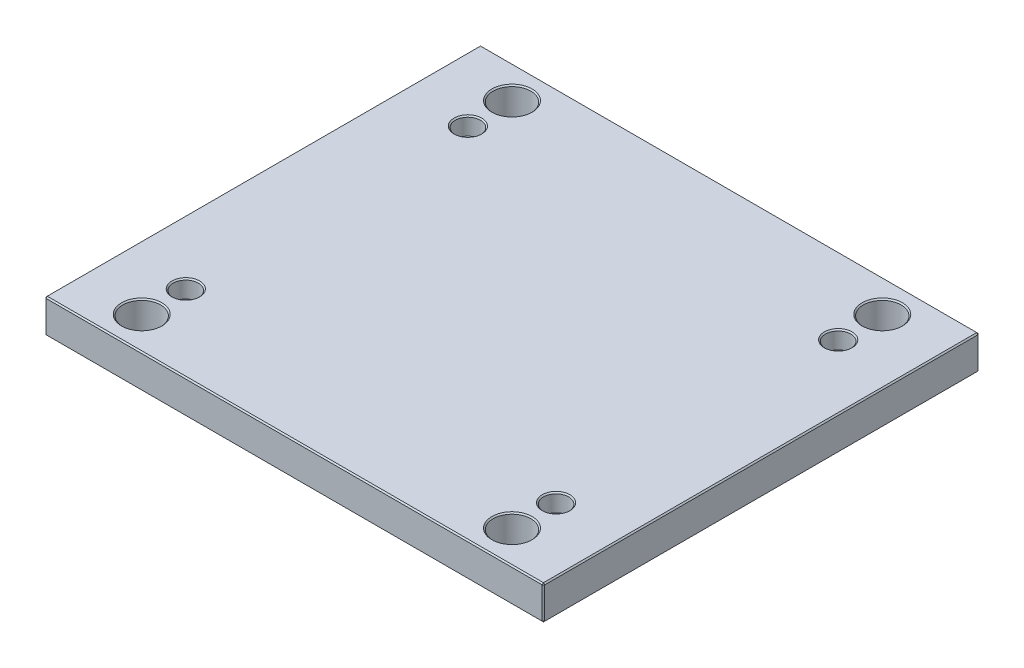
ISO-10303-21;
HEADER;
FILE_DESCRIPTION(('STEP AP214'),'2;1');
FILE_NAME('part.step','',(''),(''),'','','');
FILE_SCHEMA(('AUTOMOTIVE_DESIGN { 1 0 10303 214 1 1 1 1 }'));
ENDSEC;
DATA;
#1=APPLICATION_CONTEXT('core data for automotive mechanical design processes');
#2=APPLICATION_PROTOCOL_DEFINITION('international standard','automotive_design',2000,#1);
#3=PRODUCT_CONTEXT('',#1,'mechanical');
#4=PRODUCT('Part','Part','',(#3));
#5=PRODUCT_RELATED_PRODUCT_CATEGORY('part','',(#4));
#6=PRODUCT_DEFINITION_FORMATION('','',#4);
#7=PRODUCT_DEFINITION_CONTEXT('part definition',#1,'design');
#8=PRODUCT_DEFINITION('design','',#6,#7);
#9=PRODUCT_DEFINITION_SHAPE('','',#8);
#10=(LENGTH_UNIT() NAMED_UNIT(*) SI_UNIT(.MILLI.,.METRE.));
#11=(NAMED_UNIT(*) PLANE_ANGLE_UNIT() SI_UNIT($,.RADIAN.));
#12=(NAMED_UNIT(*) SI_UNIT($,.STERADIAN.) SOLID_ANGLE_UNIT());
#13=UNCERTAINTY_MEASURE_WITH_UNIT(LENGTH_MEASURE(1.E-05),#10,'distance_accuracy_value','');
#14=(GEOMETRIC_REPRESENTATION_CONTEXT(3) GLOBAL_UNCERTAINTY_ASSIGNED_CONTEXT((#13)) GLOBAL_UNIT_ASSIGNED_CONTEXT((#10,
#11,#12)) REPRESENTATION_CONTEXT('',''));
#15=CARTESIAN_POINT('',(0.,0.,0.));
#16=DIRECTION('',(0.,0.,1.));
#17=DIRECTION('',(1.,0.,0.));
#18=AXIS2_PLACEMENT_3D('',#15,#16,#17);
#19=CARTESIAN_POINT('',(-198.,27.,173.));
#20=DIRECTION('',(1.,0.,0.));
#21=DIRECTION('',(0.,0.,-1.));
#22=AXIS2_PLACEMENT_3D('',#19,#20,#21);
#23=PLANE('',#22);
#24=DIRECTION('',(0.,-1.,0.));
#25=VECTOR('',#24,1.);
#26=CARTESIAN_POINT('',(-198.,27.,-172.));
#27=LINE('',#26,#25);
#28=CARTESIAN_POINT('',(-198.,26.,-172.));
#29=VERTEX_POINT('',#28);
#30=CARTESIAN_POINT('',(-198.,1.,-172.));
#31=VERTEX_POINT('',#30);
#32=EDGE_CURVE('E115',#29,#31,#27,.T.);
#33=ORIENTED_EDGE('',*,*,#32,.T.);
#34=DIRECTION('',(0.,0.,1.));
#35=VECTOR('',#34,1.);
#36=CARTESIAN_POINT('',(-198.,1.,173.));
#37=LINE('',#36,#35);
#38=CARTESIAN_POINT('',(-198.,1.,172.));
#39=VERTEX_POINT('',#38);
#40=EDGE_CURVE('E111',#31,#39,#37,.T.);
#41=ORIENTED_EDGE('',*,*,#40,.T.);
#42=DIRECTION('',(0.,1.,0.));
#43=VECTOR('',#42,1.);
#44=CARTESIAN_POINT('',(-198.,27.,172.));
#45=LINE('',#44,#43);
#46=CARTESIAN_POINT('',(-198.,26.,172.));
#47=VERTEX_POINT('',#46);
#48=EDGE_CURVE('E104',#39,#47,#45,.T.);
#49=ORIENTED_EDGE('',*,*,#48,.T.);
#50=DIRECTION('',(0.,0.,-1.));
#51=VECTOR('',#50,1.);
#52=CARTESIAN_POINT('',(-198.,26.,-173.));
#53=LINE('',#52,#51);
#54=EDGE_CURVE('E108',#47,#29,#53,.T.);
#55=ORIENTED_EDGE('',*,*,#54,.T.);
#56=EDGE_LOOP('',(#33,#41,#49,#55));
#57=FACE_BOUND('',#56,.T.);
#58=ADVANCED_FACE('F16',(#57),#23,.F.);
#59=CARTESIAN_POINT('',(198.,27.,173.));
#60=DIRECTION('',(0.,0.,-1.));
#61=DIRECTION('',(-1.,0.,0.));
#62=AXIS2_PLACEMENT_3D('',#59,#60,#61);
#63=PLANE('',#62);
#64=DIRECTION('',(-1.,0.,0.));
#65=VECTOR('',#64,1.);
#66=CARTESIAN_POINT('',(-198.,26.,173.));
#67=LINE('',#66,#65);
#68=CARTESIAN_POINT('',(197.,26.,173.));
#69=VERTEX_POINT('',#68);
#70=CARTESIAN_POINT('',(-197.,26.,173.));
#71=VERTEX_POINT('',#70);
#72=EDGE_CURVE('E170',#69,#71,#67,.T.);
#73=ORIENTED_EDGE('',*,*,#72,.T.);
#74=DIRECTION('',(0.,-1.,0.));
#75=VECTOR('',#74,1.);
#76=CARTESIAN_POINT('',(-197.,27.,173.));
#77=LINE('',#76,#75);
#78=CARTESIAN_POINT('',(-197.,1.,173.));
#79=VERTEX_POINT('',#78);
#80=EDGE_CURVE('E123',#71,#79,#77,.T.);
#81=ORIENTED_EDGE('',*,*,#80,.T.);
#82=DIRECTION('',(1.,0.,0.));
#83=VECTOR('',#82,1.);
#84=CARTESIAN_POINT('',(198.,1.,173.));
#85=LINE('',#84,#83);
#86=CARTESIAN_POINT('',(197.,1.,173.));
#87=VERTEX_POINT('',#86);
#88=EDGE_CURVE('E174',#79,#87,#85,.T.);
#89=ORIENTED_EDGE('',*,*,#88,.T.);
#90=DIRECTION('',(0.,1.,0.));
#91=VECTOR('',#90,1.);
#92=CARTESIAN_POINT('',(197.,27.,173.));
#93=LINE('',#92,#91);
#94=EDGE_CURVE('E172',#87,#69,#93,.T.);
#95=ORIENTED_EDGE('',*,*,#94,.T.);
#96=EDGE_LOOP('',(#73,#81,#89,#95));
#97=FACE_BOUND('',#96,.T.);
#98=ADVANCED_FACE('F413',(#97),#63,.F.);
#99=CARTESIAN_POINT('',(198.,27.,173.));
#100=DIRECTION('',(-1.,0.,0.));
#101=DIRECTION('',(0.,0.,1.));
#102=AXIS2_PLACEMENT_3D('',#99,#100,#101);
#103=PLANE('',#102);
#104=DIRECTION('',(0.,0.,-1.));
#105=VECTOR('',#104,1.);
#106=CARTESIAN_POINT('',(198.,1.,173.));
#107=LINE('',#106,#105);
#108=CARTESIAN_POINT('',(198.,1.,172.));
#109=VERTEX_POINT('',#108);
#110=CARTESIAN_POINT('',(198.,1.,-172.));
#111=VERTEX_POINT('',#110);
#112=EDGE_CURVE('E165',#109,#111,#107,.T.);
#113=ORIENTED_EDGE('',*,*,#112,.T.);
#114=DIRECTION('',(0.,1.,0.));
#115=VECTOR('',#114,1.);
#116=CARTESIAN_POINT('',(198.,27.,-172.));
#117=LINE('',#116,#115);
#118=CARTESIAN_POINT('',(198.,26.,-172.));
#119=VERTEX_POINT('',#118);
#120=EDGE_CURVE('E167',#111,#119,#117,.T.);
#121=ORIENTED_EDGE('',*,*,#120,.T.);
#122=DIRECTION('',(0.,0.,1.));
#123=VECTOR('',#122,1.);
#124=CARTESIAN_POINT('',(198.,26.,173.));
#125=LINE('',#124,#123);
#126=CARTESIAN_POINT('',(198.,26.,172.));
#127=VERTEX_POINT('',#126);
#128=EDGE_CURVE('E161',#119,#127,#125,.T.);
#129=ORIENTED_EDGE('',*,*,#128,.T.);
#130=DIRECTION('',(0.,-1.,0.));
#131=VECTOR('',#130,1.);
#132=CARTESIAN_POINT('',(198.,27.,172.));
#133=LINE('',#132,#131);
#134=EDGE_CURVE('E163',#127,#109,#133,.T.);
#135=ORIENTED_EDGE('',*,*,#134,.T.);
#136=EDGE_LOOP('',(#113,#121,#129,#135));
#137=FACE_BOUND('',#136,.T.);
#138=ADVANCED_FACE('F406',(#137),#103,.F.);
#139=CARTESIAN_POINT('',(198.,27.,-173.));
#140=DIRECTION('',(0.,0.,1.));
#141=DIRECTION('',(1.,0.,0.));
#142=AXIS2_PLACEMENT_3D('',#139,#140,#141);
#143=PLANE('',#142);
#144=DIRECTION('',(0.,-1.,0.));
#145=VECTOR('',#144,1.);
#146=CARTESIAN_POINT('',(197.,27.,-173.));
#147=LINE('',#146,#145);
#148=CARTESIAN_POINT('',(197.,26.,-173.));
#149=VERTEX_POINT('',#148);
#150=CARTESIAN_POINT('',(197.,1.,-173.));
#151=VERTEX_POINT('',#150);
#152=EDGE_CURVE('E154',#149,#151,#147,.T.);
#153=ORIENTED_EDGE('',*,*,#152,.T.);
#154=DIRECTION('',(-1.,0.,0.));
#155=VECTOR('',#154,1.);
#156=CARTESIAN_POINT('',(198.,1.,-173.));
#157=LINE('',#156,#155);
#158=CARTESIAN_POINT('',(-197.,1.,-173.));
#159=VERTEX_POINT('',#158);
#160=EDGE_CURVE('E159',#151,#159,#157,.T.);
#161=ORIENTED_EDGE('',*,*,#160,.T.);
#162=DIRECTION('',(0.,1.,0.));
#163=VECTOR('',#162,1.);
#164=CARTESIAN_POINT('',(-197.,27.,-173.));
#165=LINE('',#164,#163);
#166=CARTESIAN_POINT('',(-197.,26.,-173.));
#167=VERTEX_POINT('',#166);
#168=EDGE_CURVE('E156',#159,#167,#165,.T.);
#169=ORIENTED_EDGE('',*,*,#168,.T.);
#170=DIRECTION('',(1.,0.,0.));
#171=VECTOR('',#170,1.);
#172=CARTESIAN_POINT('',(198.,26.,-173.));
#173=LINE('',#172,#171);
#174=EDGE_CURVE('E152',#167,#149,#173,.T.);
#175=ORIENTED_EDGE('',*,*,#174,.T.);
#176=EDGE_LOOP('',(#153,#161,#169,#175));
#177=FACE_BOUND('',#176,.T.);
#178=ADVANCED_FACE('F431',(#177),#143,.F.);
#179=CARTESIAN_POINT('',(0.,27.,0.));
#180=DIRECTION('',(0.,1.,0.));
#181=DIRECTION('',(0.,0.,1.));
#182=AXIS2_PLACEMENT_3D('',#179,#180,#181);
#183=PLANE('',#182);
#184=CARTESIAN_POINT('',(-147.,27.,147.));
#185=DIRECTION('',(0.,1.,0.));
#186=DIRECTION('',(0.,0.,1.));
#187=AXIS2_PLACEMENT_3D('',#184,#185,#186);
#188=CIRCLE('',#187,16.);
#189=CARTESIAN_POINT('',(-147.,27.,163.));
#190=VERTEX_POINT('',#189);
#191=EDGE_CURVE('E317',#190,#190,#188,.F.);
#192=ORIENTED_EDGE('',*,*,#191,.T.);
#193=EDGE_LOOP('',(#192));
#194=FACE_BOUND('',#193,.T.);
#195=CARTESIAN_POINT('',(147.,27.,147.));
#196=DIRECTION('',(0.,1.,0.));
#197=DIRECTION('',(0.,0.,1.));
#198=AXIS2_PLACEMENT_3D('',#195,#196,#197);
#199=CIRCLE('',#198,16.);
#200=CARTESIAN_POINT('',(147.,27.,163.));
#201=VERTEX_POINT('',#200);
#202=EDGE_CURVE('E314',#201,#201,#199,.F.);
#203=ORIENTED_EDGE('',*,*,#202,.T.);
#204=EDGE_LOOP('',(#203));
#205=FACE_BOUND('',#204,.T.);
#206=CARTESIAN_POINT('',(147.,27.,-147.));
#207=DIRECTION('',(0.,1.,0.));
#208=DIRECTION('',(0.,0.,1.));
#209=AXIS2_PLACEMENT_3D('',#206,#207,#208);
#210=CIRCLE('',#209,16.);
#211=CARTESIAN_POINT('',(147.,27.,-131.));
#212=VERTEX_POINT('',#211);
#213=EDGE_CURVE('E311',#212,#212,#210,.F.);
#214=ORIENTED_EDGE('',*,*,#213,.T.);
#215=EDGE_LOOP('',(#214));
#216=FACE_BOUND('',#215,.T.);
#217=CARTESIAN_POINT('',(-147.,27.,-147.));
#218=DIRECTION('',(0.,1.,0.));
#219=DIRECTION('',(0.,0.,1.));
#220=AXIS2_PLACEMENT_3D('',#217,#218,#219);
#221=CIRCLE('',#220,16.);
#222=CARTESIAN_POINT('',(-147.,27.,-131.));
#223=VERTEX_POINT('',#222);
#224=EDGE_CURVE('E308',#223,#223,#221,.F.);
#225=ORIENTED_EDGE('',*,*,#224,.T.);
#226=EDGE_LOOP('',(#225));
#227=FACE_BOUND('',#226,.T.);
#228=CARTESIAN_POINT('',(-147.,27.,112.));
#229=DIRECTION('',(0.,1.,0.));
#230=DIRECTION('',(0.,0.,1.));
#231=AXIS2_PLACEMENT_3D('',#228,#229,#230);
#232=CIRCLE('',#231,11.0000000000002);
#233=CARTESIAN_POINT('',(-147.,27.,123.));
#234=VERTEX_POINT('',#233);
#235=EDGE_CURVE('E290',#234,#234,#232,.F.);
#236=ORIENTED_EDGE('',*,*,#235,.T.);
#237=EDGE_LOOP('',(#236));
#238=FACE_BOUND('',#237,.T.);
#239=CARTESIAN_POINT('',(147.,27.,112.));
#240=DIRECTION('',(0.,1.,0.));
#241=DIRECTION('',(0.,0.,1.));
#242=AXIS2_PLACEMENT_3D('',#239,#240,#241);
#243=CIRCLE('',#242,11.0000000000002);
#244=CARTESIAN_POINT('',(147.,27.,123.));
#245=VERTEX_POINT('',#244);
#246=EDGE_CURVE('E287',#245,#245,#243,.F.);
#247=ORIENTED_EDGE('',*,*,#246,.T.);
#248=EDGE_LOOP('',(#247));
#249=FACE_BOUND('',#248,.T.);
#250=CARTESIAN_POINT('',(147.,27.,-112.));
#251=DIRECTION('',(0.,1.,0.));
#252=DIRECTION('',(0.,0.,1.));
#253=AXIS2_PLACEMENT_3D('',#250,#251,#252);
#254=CIRCLE('',#253,11.0000000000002);
#255=CARTESIAN_POINT('',(147.,27.,-101.));
#256=VERTEX_POINT('',#255);
#257=EDGE_CURVE('E284',#256,#256,#254,.F.);
#258=ORIENTED_EDGE('',*,*,#257,.T.);
#259=EDGE_LOOP('',(#258));
#260=FACE_BOUND('',#259,.T.);
#261=CARTESIAN_POINT('',(-147.,27.,-112.));
#262=DIRECTION('',(0.,1.,0.));
#263=DIRECTION('',(0.,0.,1.));
#264=AXIS2_PLACEMENT_3D('',#261,#262,#263);
#265=CIRCLE('',#264,11.0000000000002);
#266=CARTESIAN_POINT('',(-147.,27.,-101.));
#267=VERTEX_POINT('',#266);
#268=EDGE_CURVE('E281',#267,#267,#265,.F.);
#269=ORIENTED_EDGE('',*,*,#268,.T.);
#270=EDGE_LOOP('',(#269));
#271=FACE_BOUND('',#270,.T.);
#272=DIRECTION('',(0.,0.,-1.));
#273=VECTOR('',#272,1.);
#274=CARTESIAN_POINT('',(197.,27.,-173.));
#275=LINE('',#274,#273);
#276=CARTESIAN_POINT('',(197.,27.,172.));
#277=VERTEX_POINT('',#276);
#278=CARTESIAN_POINT('',(197.,27.,-172.));
#279=VERTEX_POINT('',#278);
#280=EDGE_CURVE('E31',#277,#279,#275,.T.);
#281=ORIENTED_EDGE('',*,*,#280,.T.);
#282=DIRECTION('',(-1.,0.,0.));
#283=VECTOR('',#282,1.);
#284=CARTESIAN_POINT('',(-198.,27.,-172.));
#285=LINE('',#284,#283);
#286=CARTESIAN_POINT('',(-197.,27.,-172.));
#287=VERTEX_POINT('',#286);
#288=EDGE_CURVE('E190',#279,#287,#285,.T.);
#289=ORIENTED_EDGE('',*,*,#288,.T.);
#290=DIRECTION('',(0.,0.,1.));
#291=VECTOR('',#290,1.);
#292=CARTESIAN_POINT('',(-197.,27.,173.));
#293=LINE('',#292,#291);
#294=CARTESIAN_POINT('',(-197.,27.,172.));
#295=VERTEX_POINT('',#294);
#296=EDGE_CURVE('E186',#287,#295,#293,.T.);
#297=ORIENTED_EDGE('',*,*,#296,.T.);
#298=DIRECTION('',(1.,0.,0.));
#299=VECTOR('',#298,1.);
#300=CARTESIAN_POINT('',(198.,27.,172.));
#301=LINE('',#300,#299);
#302=EDGE_CURVE('E36',#295,#277,#301,.T.);
#303=ORIENTED_EDGE('',*,*,#302,.T.);
#304=EDGE_LOOP('',(#281,#289,#297,#303));
#305=FACE_BOUND('',#304,.T.);
#306=ADVANCED_FACE('F357',(#194,#205,#216,#227,#238,#249,#260,#271,#305),#183,.T.);
#307=CARTESIAN_POINT('',(0.,0.,0.));
#308=DIRECTION('',(0.,1.,0.));
#309=DIRECTION('',(0.,0.,1.));
#310=AXIS2_PLACEMENT_3D('',#307,#308,#309);
#311=PLANE('',#310);
#312=CARTESIAN_POINT('',(-147.,0.,147.));
#313=DIRECTION('',(0.,1.,0.));
#314=DIRECTION('',(0.,0.,1.));
#315=AXIS2_PLACEMENT_3D('',#312,#313,#314);
#316=CIRCLE('',#315,16.);
#317=CARTESIAN_POINT('',(-147.,0.,163.));
#318=VERTEX_POINT('',#317);
#319=EDGE_CURVE('E329',#318,#318,#316,.T.);
#320=ORIENTED_EDGE('',*,*,#319,.T.);
#321=EDGE_LOOP('',(#320));
#322=FACE_BOUND('',#321,.T.);
#323=CARTESIAN_POINT('',(147.,0.,147.));
#324=DIRECTION('',(0.,1.,0.));
#325=DIRECTION('',(0.,0.,1.));
#326=AXIS2_PLACEMENT_3D('',#323,#324,#325);
#327=CIRCLE('',#326,16.);
#328=CARTESIAN_POINT('',(147.,0.,163.));
#329=VERTEX_POINT('',#328);
#330=EDGE_CURVE('E326',#329,#329,#327,.T.);
#331=ORIENTED_EDGE('',*,*,#330,.T.);
#332=EDGE_LOOP('',(#331));
#333=FACE_BOUND('',#332,.T.);
#334=CARTESIAN_POINT('',(147.,0.,-147.));
#335=DIRECTION('',(0.,1.,0.));
#336=DIRECTION('',(0.,0.,1.));
#337=AXIS2_PLACEMENT_3D('',#334,#335,#336);
#338=CIRCLE('',#337,16.);
#339=CARTESIAN_POINT('',(147.,0.,-131.));
#340=VERTEX_POINT('',#339);
#341=EDGE_CURVE('E323',#340,#340,#338,.T.);
#342=ORIENTED_EDGE('',*,*,#341,.T.);
#343=EDGE_LOOP('',(#342));
#344=FACE_BOUND('',#343,.T.);
#345=CARTESIAN_POINT('',(-147.,0.,-147.));
#346=DIRECTION('',(0.,1.,0.));
#347=DIRECTION('',(0.,0.,1.));
#348=AXIS2_PLACEMENT_3D('',#345,#346,#347);
#349=CIRCLE('',#348,16.);
#350=CARTESIAN_POINT('',(-147.,0.,-131.));
#351=VERTEX_POINT('',#350);
#352=EDGE_CURVE('E320',#351,#351,#349,.T.);
#353=ORIENTED_EDGE('',*,*,#352,.T.);
#354=EDGE_LOOP('',(#353));
#355=FACE_BOUND('',#354,.T.);
#356=CARTESIAN_POINT('',(147.,0.,-112.));
#357=DIRECTION('',(0.,1.,0.));
#358=DIRECTION('',(0.,0.,1.));
#359=AXIS2_PLACEMENT_3D('',#356,#357,#358);
#360=CIRCLE('',#359,8.00000000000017);
#361=CARTESIAN_POINT('',(147.,0.,-104.));
#362=VERTEX_POINT('',#361);
#363=EDGE_CURVE('E263',#362,#362,#360,.T.);
#364=ORIENTED_EDGE('',*,*,#363,.T.);
#365=EDGE_LOOP('',(#364));
#366=FACE_BOUND('',#365,.T.);
#367=CARTESIAN_POINT('',(147.,0.,112.));
#368=DIRECTION('',(0.,1.,0.));
#369=DIRECTION('',(0.,0.,1.));
#370=AXIS2_PLACEMENT_3D('',#367,#368,#369);
#371=CIRCLE('',#370,8.00000000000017);
#372=CARTESIAN_POINT('',(147.,0.,120.));
#373=VERTEX_POINT('',#372);
#374=EDGE_CURVE('E260',#373,#373,#371,.T.);
#375=ORIENTED_EDGE('',*,*,#374,.T.);
#376=EDGE_LOOP('',(#375));
#377=FACE_BOUND('',#376,.T.);
#378=CARTESIAN_POINT('',(-147.,0.,112.));
#379=DIRECTION('',(0.,1.,0.));
#380=DIRECTION('',(0.,0.,1.));
#381=AXIS2_PLACEMENT_3D('',#378,#379,#380);
#382=CIRCLE('',#381,8.);
#383=CARTESIAN_POINT('',(-147.,0.,120.));
#384=VERTEX_POINT('',#383);
#385=EDGE_CURVE('E257',#384,#384,#382,.T.);
#386=ORIENTED_EDGE('',*,*,#385,.T.);
#387=EDGE_LOOP('',(#386));
#388=FACE_BOUND('',#387,.T.);
#389=CARTESIAN_POINT('',(-147.,0.,-112.));
#390=DIRECTION('',(0.,1.,0.));
#391=DIRECTION('',(0.,0.,1.));
#392=AXIS2_PLACEMENT_3D('',#389,#390,#391);
#393=CIRCLE('',#392,8.);
#394=CARTESIAN_POINT('',(-147.,0.,-104.));
#395=VERTEX_POINT('',#394);
#396=EDGE_CURVE('E192',#395,#395,#393,.T.);
#397=ORIENTED_EDGE('',*,*,#396,.T.);
#398=EDGE_LOOP('',(#397));
#399=FACE_BOUND('',#398,.T.);
#400=DIRECTION('',(0.,0.,1.));
#401=VECTOR('',#400,1.);
#402=CARTESIAN_POINT('',(197.,0.,0.));
#403=LINE('',#402,#401);
#404=CARTESIAN_POINT('',(197.,0.,-172.));
#405=VERTEX_POINT('',#404);
#406=CARTESIAN_POINT('',(197.,0.,172.));
#407=VERTEX_POINT('',#406);
#408=EDGE_CURVE('E177',#405,#407,#403,.T.);
#409=ORIENTED_EDGE('',*,*,#408,.T.);
#410=DIRECTION('',(-1.,0.,0.));
#411=VECTOR('',#410,1.);
#412=CARTESIAN_POINT('',(0.,0.,172.));
#413=LINE('',#412,#411);
#414=CARTESIAN_POINT('',(-197.,0.,172.));
#415=VERTEX_POINT('',#414);
#416=EDGE_CURVE('E183',#407,#415,#413,.T.);
#417=ORIENTED_EDGE('',*,*,#416,.T.);
#418=DIRECTION('',(0.,0.,-1.));
#419=VECTOR('',#418,1.);
#420=CARTESIAN_POINT('',(-197.,0.,0.));
#421=LINE('',#420,#419);
#422=CARTESIAN_POINT('',(-197.,0.,-172.));
#423=VERTEX_POINT('',#422);
#424=EDGE_CURVE('E181',#415,#423,#421,.T.);
#425=ORIENTED_EDGE('',*,*,#424,.T.);
#426=DIRECTION('',(1.,0.,0.));
#427=VECTOR('',#426,1.);
#428=CARTESIAN_POINT('',(0.,0.,-172.));
#429=LINE('',#428,#427);
#430=EDGE_CURVE('E179',#423,#405,#429,.T.);
#431=ORIENTED_EDGE('',*,*,#430,.T.);
#432=EDGE_LOOP('',(#409,#417,#425,#431));
#433=FACE_BOUND('',#432,.T.);
#434=ADVANCED_FACE('F353',(#322,#333,#344,#355,#366,#377,#388,#399,#433),#311,.F.);
#435=CARTESIAN_POINT('',(198.,27.,172.));
#436=DIRECTION('',(-0.707106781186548,0.,-0.707106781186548));
#437=DIRECTION('',(0.,-1.,0.));
#438=AXIS2_PLACEMENT_3D('',#435,#436,#437);
#439=PLANE('',#438);
#440=DIRECTION('',(-0.707106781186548,0.,0.707106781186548));
#441=VECTOR('',#440,1.);
#442=CARTESIAN_POINT('',(197.,26.,173.));
#443=LINE('',#442,#441);
#444=EDGE_CURVE('E141',#69,#127,#443,.F.);
#445=ORIENTED_EDGE('',*,*,#444,.F.);
#446=ORIENTED_EDGE('',*,*,#94,.F.);
#447=DIRECTION('',(0.707106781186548,0.,-0.707106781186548));
#448=VECTOR('',#447,1.);
#449=CARTESIAN_POINT('',(197.,1.,173.));
#450=LINE('',#449,#448);
#451=EDGE_CURVE('E144',#109,#87,#450,.F.);
#452=ORIENTED_EDGE('',*,*,#451,.F.);
#453=ORIENTED_EDGE('',*,*,#134,.F.);
#454=EDGE_LOOP('',(#445,#446,#452,#453));
#455=FACE_BOUND('',#454,.T.);
#456=ADVANCED_FACE('F356',(#455),#439,.F.);
#457=CARTESIAN_POINT('',(197.,26.,173.));
#458=DIRECTION('',(0.577350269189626,0.577350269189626,0.577350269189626));
#459=DIRECTION('',(0.707106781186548,0.,-0.707106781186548));
#460=AXIS2_PLACEMENT_3D('',#457,#458,#459);
#461=PLANE('',#460);
#462=DIRECTION('',(0.,-0.707106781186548,0.707106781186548));
#463=VECTOR('',#462,1.);
#464=CARTESIAN_POINT('',(197.,26.,173.));
#465=LINE('',#464,#463);
#466=EDGE_CURVE('E235',#69,#277,#465,.F.);
#467=ORIENTED_EDGE('',*,*,#466,.F.);
#468=ORIENTED_EDGE('',*,*,#444,.T.);
#469=DIRECTION('',(-0.707106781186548,0.707106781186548,0.));
#470=VECTOR('',#469,1.);
#471=CARTESIAN_POINT('',(197.5,26.5,172.));
#472=LINE('',#471,#470);
#473=EDGE_CURVE('E237',#277,#127,#472,.F.);
#474=ORIENTED_EDGE('',*,*,#473,.F.);
#475=EDGE_LOOP('',(#467,#468,#474));
#476=FACE_BOUND('',#475,.T.);
#477=ADVANCED_FACE('F419',(#476),#461,.T.);
#478=CARTESIAN_POINT('',(197.,1.,173.));
#479=DIRECTION('',(0.577350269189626,-0.577350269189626,0.577350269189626));
#480=DIRECTION('',(0.707106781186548,0.,-0.707106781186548));
#481=AXIS2_PLACEMENT_3D('',#478,#479,#480);
#482=PLANE('',#481);
#483=DIRECTION('',(-0.707106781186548,-0.707106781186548,0.));
#484=VECTOR('',#483,1.);
#485=CARTESIAN_POINT('',(197.5,0.5,172.));
#486=LINE('',#485,#484);
#487=EDGE_CURVE('E229',#109,#407,#486,.T.);
#488=ORIENTED_EDGE('',*,*,#487,.F.);
#489=ORIENTED_EDGE('',*,*,#451,.T.);
#490=DIRECTION('',(0.,0.707106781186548,0.707106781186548));
#491=VECTOR('',#490,1.);
#492=CARTESIAN_POINT('',(197.,1.,173.));
#493=LINE('',#492,#491);
#494=EDGE_CURVE('E232',#407,#87,#493,.T.);
#495=ORIENTED_EDGE('',*,*,#494,.F.);
#496=EDGE_LOOP('',(#488,#489,#495));
#497=FACE_BOUND('',#496,.T.);
#498=ADVANCED_FACE('F378',(#497),#482,.T.);
#499=CARTESIAN_POINT('',(197.,27.,0.));
#500=DIRECTION('',(0.707106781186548,0.707106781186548,0.));
#501=DIRECTION('',(0.,0.,1.));
#502=AXIS2_PLACEMENT_3D('',#499,#500,#501);
#503=PLANE('',#502);
#504=ORIENTED_EDGE('',*,*,#473,.T.);
#505=ORIENTED_EDGE('',*,*,#128,.F.);
#506=DIRECTION('',(0.707106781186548,-0.707106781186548,0.));
#507=VECTOR('',#506,1.);
#508=CARTESIAN_POINT('',(198.,26.,-172.));
#509=LINE('',#508,#507);
#510=EDGE_CURVE('E224',#279,#119,#509,.T.);
#511=ORIENTED_EDGE('',*,*,#510,.F.);
#512=ORIENTED_EDGE('',*,*,#280,.F.);
#513=EDGE_LOOP('',(#504,#505,#511,#512));
#514=FACE_BOUND('',#513,.T.);
#515=ADVANCED_FACE('F421',(#514),#503,.T.);
#516=CARTESIAN_POINT('',(0.,27.,172.));
#517=DIRECTION('',(0.,0.707106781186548,0.707106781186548));
#518=DIRECTION('',(-1.,0.,0.));
#519=AXIS2_PLACEMENT_3D('',#516,#517,#518);
#520=PLANE('',#519);
#521=ORIENTED_EDGE('',*,*,#466,.T.);
#522=ORIENTED_EDGE('',*,*,#302,.F.);
#523=DIRECTION('',(0.,0.707106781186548,-0.707106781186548));
#524=VECTOR('',#523,1.);
#525=CARTESIAN_POINT('',(-197.,26.5,172.5));
#526=LINE('',#525,#524);
#527=EDGE_CURVE('E127',#71,#295,#526,.T.);
#528=ORIENTED_EDGE('',*,*,#527,.F.);
#529=ORIENTED_EDGE('',*,*,#72,.F.);
#530=EDGE_LOOP('',(#521,#522,#528,#529));
#531=FACE_BOUND('',#530,.T.);
#532=ADVANCED_FACE('F416',(#531),#520,.T.);
#533=CARTESIAN_POINT('',(-197.,27.,173.));
#534=DIRECTION('',(0.707106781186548,0.,-0.707106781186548));
#535=DIRECTION('',(0.,-1.,0.));
#536=AXIS2_PLACEMENT_3D('',#533,#534,#535);
#537=PLANE('',#536);
#538=DIRECTION('',(0.707106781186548,0.,0.707106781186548));
#539=VECTOR('',#538,1.);
#540=CARTESIAN_POINT('',(-197.,1.,173.));
#541=LINE('',#540,#539);
#542=EDGE_CURVE('E128',#79,#39,#541,.F.);
#543=ORIENTED_EDGE('',*,*,#542,.F.);
#544=ORIENTED_EDGE('',*,*,#80,.F.);
#545=DIRECTION('',(-0.707106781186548,0.,-0.707106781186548));
#546=VECTOR('',#545,1.);
#547=CARTESIAN_POINT('',(-198.,26.,172.));
#548=LINE('',#547,#546);
#549=EDGE_CURVE('E119',#47,#71,#548,.F.);
#550=ORIENTED_EDGE('',*,*,#549,.F.);
#551=ORIENTED_EDGE('',*,*,#48,.F.);
#552=EDGE_LOOP('',(#543,#544,#550,#551));
#553=FACE_BOUND('',#552,.T.);
#554=ADVANCED_FACE('F121',(#553),#537,.F.);
#555=CARTESIAN_POINT('',(198.,1.,173.));
#556=DIRECTION('',(0.,0.707106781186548,-0.707106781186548));
#557=DIRECTION('',(1.,0.,0.));
#558=AXIS2_PLACEMENT_3D('',#555,#556,#557);
#559=PLANE('',#558);
#560=ORIENTED_EDGE('',*,*,#494,.T.);
#561=ORIENTED_EDGE('',*,*,#88,.F.);
#562=DIRECTION('',(0.,-0.707106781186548,-0.707106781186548));
#563=VECTOR('',#562,1.);
#564=CARTESIAN_POINT('',(-197.,1.,173.));
#565=LINE('',#564,#563);
#566=EDGE_CURVE('E220',#415,#79,#565,.F.);
#567=ORIENTED_EDGE('',*,*,#566,.F.);
#568=ORIENTED_EDGE('',*,*,#416,.F.);
#569=EDGE_LOOP('',(#560,#561,#567,#568));
#570=FACE_BOUND('',#569,.T.);
#571=ADVANCED_FACE('F383',(#570),#559,.F.);
#572=CARTESIAN_POINT('',(198.,1.,173.));
#573=DIRECTION('',(-0.707106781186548,0.707106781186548,0.));
#574=DIRECTION('',(0.,0.,-1.));
#575=AXIS2_PLACEMENT_3D('',#572,#573,#574);
#576=PLANE('',#575);
#577=ORIENTED_EDGE('',*,*,#487,.T.);
#578=ORIENTED_EDGE('',*,*,#408,.F.);
#579=DIRECTION('',(0.707106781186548,0.707106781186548,0.));
#580=VECTOR('',#579,1.);
#581=CARTESIAN_POINT('',(197.5,0.499999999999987,-172.));
#582=LINE('',#581,#580);
#583=EDGE_CURVE('E217',#111,#405,#582,.F.);
#584=ORIENTED_EDGE('',*,*,#583,.F.);
#585=ORIENTED_EDGE('',*,*,#112,.F.);
#586=EDGE_LOOP('',(#577,#578,#584,#585));
#587=FACE_BOUND('',#586,.T.);
#588=ADVANCED_FACE('F376',(#587),#576,.F.);
#589=CARTESIAN_POINT('',(197.,27.,-173.));
#590=DIRECTION('',(-0.707106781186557,0.,0.707106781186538));
#591=DIRECTION('',(0.,-1.,0.));
#592=AXIS2_PLACEMENT_3D('',#589,#590,#591);
#593=PLANE('',#592);
#594=DIRECTION('',(0.707106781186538,0.,0.707106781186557));
#595=VECTOR('',#594,1.);
#596=CARTESIAN_POINT('',(198.,26.,-172.));
#597=LINE('',#596,#595);
#598=EDGE_CURVE('E226',#119,#149,#597,.F.);
#599=ORIENTED_EDGE('',*,*,#598,.F.);
#600=ORIENTED_EDGE('',*,*,#120,.F.);
#601=DIRECTION('',(-0.707106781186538,0.,-0.707106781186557));
#602=VECTOR('',#601,1.);
#603=CARTESIAN_POINT('',(197.,1.,-173.));
#604=LINE('',#603,#602);
#605=EDGE_CURVE('E214',#151,#111,#604,.F.);
#606=ORIENTED_EDGE('',*,*,#605,.F.);
#607=ORIENTED_EDGE('',*,*,#152,.F.);
#608=EDGE_LOOP('',(#599,#600,#606,#607));
#609=FACE_BOUND('',#608,.T.);
#610=ADVANCED_FACE('F403',(#609),#593,.F.);
#611=CARTESIAN_POINT('',(198.,26.,-172.));
#612=DIRECTION('',(0.577350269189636,0.57735026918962,-0.57735026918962));
#613=DIRECTION('',(-0.707106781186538,0.,-0.707106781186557));
#614=AXIS2_PLACEMENT_3D('',#611,#612,#613);
#615=PLANE('',#614);
#616=ORIENTED_EDGE('',*,*,#510,.T.);
#617=ORIENTED_EDGE('',*,*,#598,.T.);
#618=DIRECTION('',(0.,0.707106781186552,0.707106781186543));
#619=VECTOR('',#618,1.);
#620=CARTESIAN_POINT('',(197.,26.5,-172.5));
#621=LINE('',#620,#619);
#622=EDGE_CURVE('E135',#279,#149,#621,.F.);
#623=ORIENTED_EDGE('',*,*,#622,.F.);
#624=EDGE_LOOP('',(#616,#617,#623));
#625=FACE_BOUND('',#624,.T.);
#626=ADVANCED_FACE('F425',(#625),#615,.T.);
#627=CARTESIAN_POINT('',(-198.,26.,172.));
#628=DIRECTION('',(-0.577350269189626,0.577350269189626,0.577350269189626));
#629=DIRECTION('',(0.707106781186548,0.,0.707106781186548));
#630=AXIS2_PLACEMENT_3D('',#627,#628,#629);
#631=PLANE('',#630);
#632=ORIENTED_EDGE('',*,*,#549,.T.);
#633=ORIENTED_EDGE('',*,*,#527,.T.);
#634=DIRECTION('',(-0.707106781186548,-0.707106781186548,0.));
#635=VECTOR('',#634,1.);
#636=CARTESIAN_POINT('',(-198.,26.,172.));
#637=LINE('',#636,#635);
#638=EDGE_CURVE('E131',#47,#295,#637,.F.);
#639=ORIENTED_EDGE('',*,*,#638,.F.);
#640=EDGE_LOOP('',(#632,#633,#639));
#641=FACE_BOUND('',#640,.T.);
#642=ADVANCED_FACE('F132',(#641),#631,.T.);
#643=CARTESIAN_POINT('',(-197.,1.,173.));
#644=DIRECTION('',(-0.577350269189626,-0.577350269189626,0.577350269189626));
#645=DIRECTION('',(0.707106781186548,0.,0.707106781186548));
#646=AXIS2_PLACEMENT_3D('',#643,#644,#645);
#647=PLANE('',#646);
#648=ORIENTED_EDGE('',*,*,#566,.T.);
#649=ORIENTED_EDGE('',*,*,#542,.T.);
#650=DIRECTION('',(-0.707106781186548,0.707106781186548,0.));
#651=VECTOR('',#650,1.);
#652=CARTESIAN_POINT('',(-197.5,0.5,172.));
#653=LINE('',#652,#651);
#654=EDGE_CURVE('E136',#415,#39,#653,.T.);
#655=ORIENTED_EDGE('',*,*,#654,.F.);
#656=EDGE_LOOP('',(#648,#649,#655));
#657=FACE_BOUND('',#656,.T.);
#658=ADVANCED_FACE('F386',(#657),#647,.T.);
#659=CARTESIAN_POINT('',(197.,1.,-173.));
#660=DIRECTION('',(0.577350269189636,-0.57735026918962,-0.57735026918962));
#661=DIRECTION('',(-0.707106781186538,0.,-0.707106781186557));
#662=AXIS2_PLACEMENT_3D('',#659,#660,#661);
#663=PLANE('',#662);
#664=ORIENTED_EDGE('',*,*,#605,.T.);
#665=ORIENTED_EDGE('',*,*,#583,.T.);
#666=DIRECTION('',(0.,-0.707106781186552,0.707106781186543));
#667=VECTOR('',#666,1.);
#668=CARTESIAN_POINT('',(197.,1.,-173.));
#669=LINE('',#668,#667);
#670=EDGE_CURVE('E207',#151,#405,#669,.T.);
#671=ORIENTED_EDGE('',*,*,#670,.F.);
#672=EDGE_LOOP('',(#664,#665,#671));
#673=FACE_BOUND('',#672,.T.);
#674=ADVANCED_FACE('F397',(#673),#663,.T.);
#675=CARTESIAN_POINT('',(0.,27.,-172.));
#676=DIRECTION('',(0.,0.707106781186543,-0.707106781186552));
#677=DIRECTION('',(1.,0.,0.));
#678=AXIS2_PLACEMENT_3D('',#675,#676,#677);
#679=PLANE('',#678);
#680=ORIENTED_EDGE('',*,*,#622,.T.);
#681=ORIENTED_EDGE('',*,*,#174,.F.);
#682=DIRECTION('',(0.,-0.707106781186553,-0.707106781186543));
#683=VECTOR('',#682,1.);
#684=CARTESIAN_POINT('',(-197.,26.,-173.));
#685=LINE('',#684,#683);
#686=EDGE_CURVE('E204',#287,#167,#685,.T.);
#687=ORIENTED_EDGE('',*,*,#686,.F.);
#688=ORIENTED_EDGE('',*,*,#288,.F.);
#689=EDGE_LOOP('',(#680,#681,#687,#688));
#690=FACE_BOUND('',#689,.T.);
#691=ADVANCED_FACE('F429',(#690),#679,.T.);
#692=CARTESIAN_POINT('',(-197.,27.,0.));
#693=DIRECTION('',(-0.707106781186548,0.707106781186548,0.));
#694=DIRECTION('',(0.,0.,-1.));
#695=AXIS2_PLACEMENT_3D('',#692,#693,#694);
#696=PLANE('',#695);
#697=ORIENTED_EDGE('',*,*,#638,.T.);
#698=ORIENTED_EDGE('',*,*,#296,.F.);
#699=DIRECTION('',(0.707106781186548,0.707106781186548,0.));
#700=VECTOR('',#699,1.);
#701=CARTESIAN_POINT('',(-197.5,26.5,-172.));
#702=LINE('',#701,#700);
#703=EDGE_CURVE('E139',#29,#287,#702,.T.);
#704=ORIENTED_EDGE('',*,*,#703,.F.);
#705=ORIENTED_EDGE('',*,*,#54,.F.);
#706=EDGE_LOOP('',(#697,#698,#704,#705));
#707=FACE_BOUND('',#706,.T.);
#708=ADVANCED_FACE('F138',(#707),#696,.T.);
#709=CARTESIAN_POINT('',(-198.,1.,173.));
#710=DIRECTION('',(0.707106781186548,0.707106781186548,0.));
#711=DIRECTION('',(0.,0.,1.));
#712=AXIS2_PLACEMENT_3D('',#709,#710,#711);
#713=PLANE('',#712);
#714=ORIENTED_EDGE('',*,*,#654,.T.);
#715=ORIENTED_EDGE('',*,*,#40,.F.);
#716=DIRECTION('',(0.707106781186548,-0.707106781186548,0.));
#717=VECTOR('',#716,1.);
#718=CARTESIAN_POINT('',(-198.,1.,-172.));
#719=LINE('',#718,#717);
#720=EDGE_CURVE('E200',#423,#31,#719,.F.);
#721=ORIENTED_EDGE('',*,*,#720,.F.);
#722=ORIENTED_EDGE('',*,*,#424,.F.);
#723=EDGE_LOOP('',(#714,#715,#721,#722));
#724=FACE_BOUND('',#723,.T.);
#725=ADVANCED_FACE('F388',(#724),#713,.F.);
#726=CARTESIAN_POINT('',(198.,1.,-173.));
#727=DIRECTION('',(0.,0.707106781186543,0.707106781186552));
#728=DIRECTION('',(-1.,0.,0.));
#729=AXIS2_PLACEMENT_3D('',#726,#727,#728);
#730=PLANE('',#729);
#731=ORIENTED_EDGE('',*,*,#670,.T.);
#732=ORIENTED_EDGE('',*,*,#430,.F.);
#733=DIRECTION('',(0.,0.707106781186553,-0.707106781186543));
#734=VECTOR('',#733,1.);
#735=CARTESIAN_POINT('',(-197.,0.500000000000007,-172.5));
#736=LINE('',#735,#734);
#737=EDGE_CURVE('E197',#159,#423,#736,.F.);
#738=ORIENTED_EDGE('',*,*,#737,.F.);
#739=ORIENTED_EDGE('',*,*,#160,.F.);
#740=EDGE_LOOP('',(#731,#732,#738,#739));
#741=FACE_BOUND('',#740,.T.);
#742=ADVANCED_FACE('F392',(#741),#730,.F.);
#743=CARTESIAN_POINT('',(-197.,26.,-173.));
#744=DIRECTION('',(-0.577350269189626,0.577350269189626,-0.577350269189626));
#745=DIRECTION('',(-0.707106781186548,0.,0.707106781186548));
#746=AXIS2_PLACEMENT_3D('',#743,#744,#745);
#747=PLANE('',#746);
#748=ORIENTED_EDGE('',*,*,#703,.T.);
#749=ORIENTED_EDGE('',*,*,#686,.T.);
#750=DIRECTION('',(0.707106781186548,0.,-0.707106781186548));
#751=VECTOR('',#750,1.);
#752=CARTESIAN_POINT('',(-197.,26.,-173.));
#753=LINE('',#752,#751);
#754=EDGE_CURVE('E195',#29,#167,#753,.T.);
#755=ORIENTED_EDGE('',*,*,#754,.F.);
#756=EDGE_LOOP('',(#748,#749,#755));
#757=FACE_BOUND('',#756,.T.);
#758=ADVANCED_FACE('F460',(#757),#747,.T.);
#759=CARTESIAN_POINT('',(-198.,1.,-172.));
#760=DIRECTION('',(-0.577350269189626,-0.577350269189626,-0.577350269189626));
#761=DIRECTION('',(-0.707106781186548,0.,0.707106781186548));
#762=AXIS2_PLACEMENT_3D('',#759,#760,#761);
#763=PLANE('',#762);
#764=ORIENTED_EDGE('',*,*,#737,.T.);
#765=ORIENTED_EDGE('',*,*,#720,.T.);
#766=DIRECTION('',(-0.707106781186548,0.,0.707106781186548));
#767=VECTOR('',#766,1.);
#768=CARTESIAN_POINT('',(-198.,1.,-172.));
#769=LINE('',#768,#767);
#770=EDGE_CURVE('E193',#159,#31,#769,.T.);
#771=ORIENTED_EDGE('',*,*,#770,.F.);
#772=EDGE_LOOP('',(#764,#765,#771));
#773=FACE_BOUND('',#772,.T.);
#774=ADVANCED_FACE('F456',(#773),#763,.T.);
#775=CARTESIAN_POINT('',(-198.,27.,-172.));
#776=DIRECTION('',(0.707106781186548,0.,0.707106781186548));
#777=DIRECTION('',(0.,-1.,0.));
#778=AXIS2_PLACEMENT_3D('',#775,#776,#777);
#779=PLANE('',#778);
#780=ORIENTED_EDGE('',*,*,#754,.T.);
#781=ORIENTED_EDGE('',*,*,#168,.F.);
#782=ORIENTED_EDGE('',*,*,#770,.T.);
#783=ORIENTED_EDGE('',*,*,#32,.F.);
#784=EDGE_LOOP('',(#780,#781,#782,#783));
#785=FACE_BOUND('',#784,.T.);
#786=ADVANCED_FACE('F452',(#785),#779,.F.);
#787=CARTESIAN_POINT('',(-147.,13.,-112.));
#788=DIRECTION('',(0.,1.,0.));
#789=DIRECTION('',(0.,0.,1.));
#790=AXIS2_PLACEMENT_3D('',#787,#788,#789);
#791=CYLINDRICAL_SURFACE('',#790,10.);
#792=CARTESIAN_POINT('',(-147.,26.,-112.));
#793=DIRECTION('',(0.,1.,0.));
#794=DIRECTION('',(0.,0.,1.));
#795=AXIS2_PLACEMENT_3D('',#792,#793,#794);
#796=CIRCLE('',#795,10.);
#797=CARTESIAN_POINT('',(-147.,26.,-102.));
#798=VERTEX_POINT('',#797);
#799=EDGE_CURVE('E299',#798,#798,#796,.T.);
#800=ORIENTED_EDGE('',*,*,#799,.T.);
#801=EDGE_LOOP('',(#800));
#802=FACE_BOUND('',#801,.T.);
#803=CARTESIAN_POINT('',(-147.,13.,-112.));
#804=DIRECTION('',(0.,1.,0.));
#805=DIRECTION('',(0.,0.,1.));
#806=AXIS2_PLACEMENT_3D('',#803,#804,#805);
#807=CIRCLE('',#806,10.);
#808=CARTESIAN_POINT('',(-147.,13.,-102.));
#809=VERTEX_POINT('',#808);
#810=EDGE_CURVE('E147',#809,#809,#807,.T.);
#811=ORIENTED_EDGE('',*,*,#810,.F.);
#812=EDGE_LOOP('',(#811));
#813=FACE_BOUND('',#812,.T.);
#814=ADVANCED_FACE('F455',(#802,#813),#791,.F.);
#815=CARTESIAN_POINT('',(-147.,13.,-112.));
#816=DIRECTION('',(0.,1.,0.));
#817=DIRECTION('',(0.,0.,1.));
#818=AXIS2_PLACEMENT_3D('',#815,#816,#817);
#819=PLANE('',#818);
#820=CARTESIAN_POINT('',(-147.,13.,-112.));
#821=DIRECTION('',(0.,1.,0.));
#822=DIRECTION('',(0.,0.,1.));
#823=AXIS2_PLACEMENT_3D('',#820,#821,#822);
#824=CIRCLE('',#823,7.);
#825=CARTESIAN_POINT('',(-147.,13.,-105.));
#826=VERTEX_POINT('',#825);
#827=EDGE_CURVE('E251',#826,#826,#824,.T.);
#828=ORIENTED_EDGE('',*,*,#827,.F.);
#829=EDGE_LOOP('',(#828));
#830=FACE_BOUND('',#829,.T.);
#831=ORIENTED_EDGE('',*,*,#810,.T.);
#832=EDGE_LOOP('',(#831));
#833=FACE_BOUND('',#832,.T.);
#834=ADVANCED_FACE('F602',(#830,#833),#819,.T.);
#835=CARTESIAN_POINT('',(147.,13.,-112.));
#836=DIRECTION('',(0.,1.,0.));
#837=DIRECTION('',(0.,0.,1.));
#838=AXIS2_PLACEMENT_3D('',#835,#836,#837);
#839=CYLINDRICAL_SURFACE('',#838,10.);
#840=CARTESIAN_POINT('',(147.,26.,-112.));
#841=DIRECTION('',(0.,1.,0.));
#842=DIRECTION('',(0.,0.,1.));
#843=AXIS2_PLACEMENT_3D('',#840,#841,#842);
#844=CIRCLE('',#843,10.);
#845=CARTESIAN_POINT('',(147.,26.,-102.));
#846=VERTEX_POINT('',#845);
#847=EDGE_CURVE('E296',#846,#846,#844,.T.);
#848=ORIENTED_EDGE('',*,*,#847,.T.);
#849=EDGE_LOOP('',(#848));
#850=FACE_BOUND('',#849,.T.);
#851=CARTESIAN_POINT('',(147.,13.,-112.));
#852=DIRECTION('',(0.,1.,0.));
#853=DIRECTION('',(0.,0.,1.));
#854=AXIS2_PLACEMENT_3D('',#851,#852,#853);
#855=CIRCLE('',#854,10.);
#856=CARTESIAN_POINT('',(147.,13.,-102.));
#857=VERTEX_POINT('',#856);
#858=EDGE_CURVE('E630',#857,#857,#855,.T.);
#859=ORIENTED_EDGE('',*,*,#858,.F.);
#860=EDGE_LOOP('',(#859));
#861=FACE_BOUND('',#860,.T.);
#862=ADVANCED_FACE('F598',(#850,#861),#839,.F.);
#863=CARTESIAN_POINT('',(147.,13.,-112.));
#864=DIRECTION('',(0.,1.,0.));
#865=DIRECTION('',(0.,0.,1.));
#866=AXIS2_PLACEMENT_3D('',#863,#864,#865);
#867=PLANE('',#866);
#868=CARTESIAN_POINT('',(147.,13.,-112.));
#869=DIRECTION('',(0.,1.,0.));
#870=DIRECTION('',(0.,0.,1.));
#871=AXIS2_PLACEMENT_3D('',#868,#869,#870);
#872=CIRCLE('',#871,7.);
#873=CARTESIAN_POINT('',(147.,13.,-105.));
#874=VERTEX_POINT('',#873);
#875=EDGE_CURVE('E248',#874,#874,#872,.T.);
#876=ORIENTED_EDGE('',*,*,#875,.F.);
#877=EDGE_LOOP('',(#876));
#878=FACE_BOUND('',#877,.T.);
#879=ORIENTED_EDGE('',*,*,#858,.T.);
#880=EDGE_LOOP('',(#879));
#881=FACE_BOUND('',#880,.T.);
#882=ADVANCED_FACE('F594',(#878,#881),#867,.T.);
#883=CARTESIAN_POINT('',(147.,13.,112.));
#884=DIRECTION('',(0.,1.,0.));
#885=DIRECTION('',(0.,0.,1.));
#886=AXIS2_PLACEMENT_3D('',#883,#884,#885);
#887=CYLINDRICAL_SURFACE('',#886,10.);
#888=CARTESIAN_POINT('',(147.,26.,112.));
#889=DIRECTION('',(0.,1.,0.));
#890=DIRECTION('',(0.,0.,1.));
#891=AXIS2_PLACEMENT_3D('',#888,#889,#890);
#892=CIRCLE('',#891,10.);
#893=CARTESIAN_POINT('',(147.,26.,122.));
#894=VERTEX_POINT('',#893);
#895=EDGE_CURVE('E293',#894,#894,#892,.T.);
#896=ORIENTED_EDGE('',*,*,#895,.T.);
#897=EDGE_LOOP('',(#896));
#898=FACE_BOUND('',#897,.T.);
#899=CARTESIAN_POINT('',(147.,13.,112.));
#900=DIRECTION('',(0.,1.,0.));
#901=DIRECTION('',(0.,0.,1.));
#902=AXIS2_PLACEMENT_3D('',#899,#900,#901);
#903=CIRCLE('',#902,10.);
#904=CARTESIAN_POINT('',(147.,13.,122.));
#905=VERTEX_POINT('',#904);
#906=EDGE_CURVE('E632',#905,#905,#903,.T.);
#907=ORIENTED_EDGE('',*,*,#906,.F.);
#908=EDGE_LOOP('',(#907));
#909=FACE_BOUND('',#908,.T.);
#910=ADVANCED_FACE('F597',(#898,#909),#887,.F.);
#911=CARTESIAN_POINT('',(147.,13.,112.));
#912=DIRECTION('',(0.,1.,0.));
#913=DIRECTION('',(0.,0.,1.));
#914=AXIS2_PLACEMENT_3D('',#911,#912,#913);
#915=PLANE('',#914);
#916=CARTESIAN_POINT('',(147.,13.,112.));
#917=DIRECTION('',(0.,1.,0.));
#918=DIRECTION('',(0.,0.,1.));
#919=AXIS2_PLACEMENT_3D('',#916,#917,#918);
#920=CIRCLE('',#919,7.);
#921=CARTESIAN_POINT('',(147.,13.,119.));
#922=VERTEX_POINT('',#921);
#923=EDGE_CURVE('E245',#922,#922,#920,.T.);
#924=ORIENTED_EDGE('',*,*,#923,.F.);
#925=EDGE_LOOP('',(#924));
#926=FACE_BOUND('',#925,.T.);
#927=ORIENTED_EDGE('',*,*,#906,.T.);
#928=EDGE_LOOP('',(#927));
#929=FACE_BOUND('',#928,.T.);
#930=ADVANCED_FACE('F604',(#926,#929),#915,.T.);
#931=CARTESIAN_POINT('',(-147.,13.,112.));
#932=DIRECTION('',(0.,1.,0.));
#933=DIRECTION('',(0.,0.,1.));
#934=AXIS2_PLACEMENT_3D('',#931,#932,#933);
#935=CYLINDRICAL_SURFACE('',#934,10.);
#936=CARTESIAN_POINT('',(-147.,26.,112.));
#937=DIRECTION('',(0.,1.,0.));
#938=DIRECTION('',(0.,0.,1.));
#939=AXIS2_PLACEMENT_3D('',#936,#937,#938);
#940=CIRCLE('',#939,10.);
#941=CARTESIAN_POINT('',(-147.,26.,122.));
#942=VERTEX_POINT('',#941);
#943=EDGE_CURVE('E278',#942,#942,#940,.T.);
#944=ORIENTED_EDGE('',*,*,#943,.T.);
#945=EDGE_LOOP('',(#944));
#946=FACE_BOUND('',#945,.T.);
#947=CARTESIAN_POINT('',(-147.,13.,112.));
#948=DIRECTION('',(0.,1.,0.));
#949=DIRECTION('',(0.,0.,1.));
#950=AXIS2_PLACEMENT_3D('',#947,#948,#949);
#951=CIRCLE('',#950,10.);
#952=CARTESIAN_POINT('',(-147.,13.,122.));
#953=VERTEX_POINT('',#952);
#954=EDGE_CURVE('E254',#953,#953,#951,.T.);
#955=ORIENTED_EDGE('',*,*,#954,.F.);
#956=EDGE_LOOP('',(#955));
#957=FACE_BOUND('',#956,.T.);
#958=ADVANCED_FACE('F607',(#946,#957),#935,.F.);
#959=CARTESIAN_POINT('',(-147.,13.,112.));
#960=DIRECTION('',(0.,1.,0.));
#961=DIRECTION('',(0.,0.,1.));
#962=AXIS2_PLACEMENT_3D('',#959,#960,#961);
#963=PLANE('',#962);
#964=CARTESIAN_POINT('',(-147.,13.,112.));
#965=DIRECTION('',(0.,1.,0.));
#966=DIRECTION('',(0.,0.,1.));
#967=AXIS2_PLACEMENT_3D('',#964,#965,#966);
#968=CIRCLE('',#967,7.);
#969=CARTESIAN_POINT('',(-147.,13.,119.));
#970=VERTEX_POINT('',#969);
#971=EDGE_CURVE('E242',#970,#970,#968,.T.);
#972=ORIENTED_EDGE('',*,*,#971,.F.);
#973=EDGE_LOOP('',(#972));
#974=FACE_BOUND('',#973,.T.);
#975=ORIENTED_EDGE('',*,*,#954,.T.);
#976=EDGE_LOOP('',(#975));
#977=FACE_BOUND('',#976,.T.);
#978=ADVANCED_FACE('F589',(#974,#977),#963,.T.);
#979=CARTESIAN_POINT('',(-147.,0.,112.));
#980=DIRECTION('',(0.,1.,0.));
#981=DIRECTION('',(0.,0.,1.));
#982=AXIS2_PLACEMENT_3D('',#979,#980,#981);
#983=CYLINDRICAL_SURFACE('',#982,7.);
#984=CARTESIAN_POINT('',(-147.,1.00000000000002,112.));
#985=DIRECTION('',(0.,1.,0.));
#986=DIRECTION('',(0.,0.,1.));
#987=AXIS2_PLACEMENT_3D('',#984,#985,#986);
#988=CIRCLE('',#987,7.);
#989=CARTESIAN_POINT('',(-147.,1.00000000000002,119.));
#990=VERTEX_POINT('',#989);
#991=EDGE_CURVE('E272',#990,#990,#988,.F.);
#992=ORIENTED_EDGE('',*,*,#991,.T.);
#993=EDGE_LOOP('',(#992));
#994=FACE_BOUND('',#993,.T.);
#995=ORIENTED_EDGE('',*,*,#971,.T.);
#996=EDGE_LOOP('',(#995));
#997=FACE_BOUND('',#996,.T.);
#998=ADVANCED_FACE('F585',(#994,#997),#983,.F.);
#999=CARTESIAN_POINT('',(147.,0.,112.));
#1000=DIRECTION('',(0.,1.,0.));
#1001=DIRECTION('',(0.,0.,1.));
#1002=AXIS2_PLACEMENT_3D('',#999,#1000,#1001);
#1003=CYLINDRICAL_SURFACE('',#1002,7.);
#1004=CARTESIAN_POINT('',(147.,1.00000000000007,112.));
#1005=DIRECTION('',(0.,1.,0.));
#1006=DIRECTION('',(0.,0.,1.));
#1007=AXIS2_PLACEMENT_3D('',#1004,#1005,#1006);
#1008=CIRCLE('',#1007,7.);
#1009=CARTESIAN_POINT('',(147.,1.00000000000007,119.));
#1010=VERTEX_POINT('',#1009);
#1011=EDGE_CURVE('E269',#1010,#1010,#1008,.F.);
#1012=ORIENTED_EDGE('',*,*,#1011,.T.);
#1013=EDGE_LOOP('',(#1012));
#1014=FACE_BOUND('',#1013,.T.);
#1015=ORIENTED_EDGE('',*,*,#923,.T.);
#1016=EDGE_LOOP('',(#1015));
#1017=FACE_BOUND('',#1016,.T.);
#1018=ADVANCED_FACE('F581',(#1014,#1017),#1003,.F.);
#1019=CARTESIAN_POINT('',(147.,0.,-112.));
#1020=DIRECTION('',(0.,1.,0.));
#1021=DIRECTION('',(0.,0.,1.));
#1022=AXIS2_PLACEMENT_3D('',#1019,#1020,#1021);
#1023=CYLINDRICAL_SURFACE('',#1022,7.);
#1024=CARTESIAN_POINT('',(147.,1.00000000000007,-112.));
#1025=DIRECTION('',(0.,1.,0.));
#1026=DIRECTION('',(0.,0.,1.));
#1027=AXIS2_PLACEMENT_3D('',#1024,#1025,#1026);
#1028=CIRCLE('',#1027,7.);
#1029=CARTESIAN_POINT('',(147.,1.00000000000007,-105.));
#1030=VERTEX_POINT('',#1029);
#1031=EDGE_CURVE('E266',#1030,#1030,#1028,.F.);
#1032=ORIENTED_EDGE('',*,*,#1031,.T.);
#1033=EDGE_LOOP('',(#1032));
#1034=FACE_BOUND('',#1033,.T.);
#1035=ORIENTED_EDGE('',*,*,#875,.T.);
#1036=EDGE_LOOP('',(#1035));
#1037=FACE_BOUND('',#1036,.T.);
#1038=ADVANCED_FACE('F578',(#1034,#1037),#1023,.F.);
#1039=CARTESIAN_POINT('',(-147.,0.,-112.));
#1040=DIRECTION('',(0.,1.,0.));
#1041=DIRECTION('',(0.,0.,1.));
#1042=AXIS2_PLACEMENT_3D('',#1039,#1040,#1041);
#1043=CYLINDRICAL_SURFACE('',#1042,7.);
#1044=CARTESIAN_POINT('',(-147.,1.00000000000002,-112.));
#1045=DIRECTION('',(0.,1.,0.));
#1046=DIRECTION('',(0.,0.,1.));
#1047=AXIS2_PLACEMENT_3D('',#1044,#1045,#1046);
#1048=CIRCLE('',#1047,7.);
#1049=CARTESIAN_POINT('',(-147.,1.00000000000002,-105.));
#1050=VERTEX_POINT('',#1049);
#1051=EDGE_CURVE('E275',#1050,#1050,#1048,.F.);
#1052=ORIENTED_EDGE('',*,*,#1051,.T.);
#1053=EDGE_LOOP('',(#1052));
#1054=FACE_BOUND('',#1053,.T.);
#1055=ORIENTED_EDGE('',*,*,#827,.T.);
#1056=EDGE_LOOP('',(#1055));
#1057=FACE_BOUND('',#1056,.T.);
#1058=ADVANCED_FACE('F503',(#1054,#1057),#1043,.F.);
#1059=CARTESIAN_POINT('',(147.,0.,-112.));
#1060=DIRECTION('',(0.,-1.,0.));
#1061=DIRECTION('',(0.,0.,-1.));
#1062=AXIS2_PLACEMENT_3D('',#1059,#1060,#1061);
#1063=CONICAL_SURFACE('',#1062,8.00000000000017,0.785398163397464);
#1064=ORIENTED_EDGE('',*,*,#1031,.F.);
#1065=EDGE_LOOP('',(#1064));
#1066=FACE_BOUND('',#1065,.T.);
#1067=ORIENTED_EDGE('',*,*,#363,.F.);
#1068=EDGE_LOOP('',(#1067));
#1069=FACE_BOUND('',#1068,.T.);
#1070=ADVANCED_FACE('F499',(#1066,#1069),#1063,.F.);
#1071=CARTESIAN_POINT('',(147.,0.,112.));
#1072=DIRECTION('',(0.,-1.,0.));
#1073=DIRECTION('',(0.,0.,-1.));
#1074=AXIS2_PLACEMENT_3D('',#1071,#1072,#1073);
#1075=CONICAL_SURFACE('',#1074,8.00000000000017,0.785398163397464);
#1076=ORIENTED_EDGE('',*,*,#1011,.F.);
#1077=EDGE_LOOP('',(#1076));
#1078=FACE_BOUND('',#1077,.T.);
#1079=ORIENTED_EDGE('',*,*,#374,.F.);
#1080=EDGE_LOOP('',(#1079));
#1081=FACE_BOUND('',#1080,.T.);
#1082=ADVANCED_FACE('F502',(#1078,#1081),#1075,.F.);
#1083=CARTESIAN_POINT('',(-147.,0.,112.));
#1084=DIRECTION('',(0.,-1.,0.));
#1085=DIRECTION('',(0.,0.,-1.));
#1086=AXIS2_PLACEMENT_3D('',#1083,#1084,#1085);
#1087=CONICAL_SURFACE('',#1086,8.,0.785398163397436);
#1088=ORIENTED_EDGE('',*,*,#991,.F.);
#1089=EDGE_LOOP('',(#1088));
#1090=FACE_BOUND('',#1089,.T.);
#1091=ORIENTED_EDGE('',*,*,#385,.F.);
#1092=EDGE_LOOP('',(#1091));
#1093=FACE_BOUND('',#1092,.T.);
#1094=ADVANCED_FACE('F507',(#1090,#1093),#1087,.F.);
#1095=CARTESIAN_POINT('',(-147.,0.,-112.));
#1096=DIRECTION('',(0.,-1.,0.));
#1097=DIRECTION('',(0.,0.,-1.));
#1098=AXIS2_PLACEMENT_3D('',#1095,#1096,#1097);
#1099=CONICAL_SURFACE('',#1098,8.,0.785398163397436);
#1100=ORIENTED_EDGE('',*,*,#1051,.F.);
#1101=EDGE_LOOP('',(#1100));
#1102=FACE_BOUND('',#1101,.T.);
#1103=ORIENTED_EDGE('',*,*,#396,.F.);
#1104=EDGE_LOOP('',(#1103));
#1105=FACE_BOUND('',#1104,.T.);
#1106=ADVANCED_FACE('F511',(#1102,#1105),#1099,.F.);
#1107=CARTESIAN_POINT('',(-147.,26.,112.));
#1108=DIRECTION('',(0.,1.,0.));
#1109=DIRECTION('',(0.,0.,1.));
#1110=AXIS2_PLACEMENT_3D('',#1107,#1108,#1109);
#1111=CONICAL_SURFACE('',#1110,10.,0.785398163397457);
#1112=ORIENTED_EDGE('',*,*,#235,.F.);
#1113=EDGE_LOOP('',(#1112));
#1114=FACE_BOUND('',#1113,.T.);
#1115=ORIENTED_EDGE('',*,*,#943,.F.);
#1116=EDGE_LOOP('',(#1115));
#1117=FACE_BOUND('',#1116,.T.);
#1118=ADVANCED_FACE('F515',(#1114,#1117),#1111,.F.);
#1119=CARTESIAN_POINT('',(147.,26.,112.));
#1120=DIRECTION('',(0.,1.,0.));
#1121=DIRECTION('',(0.,0.,1.));
#1122=AXIS2_PLACEMENT_3D('',#1119,#1120,#1121);
#1123=CONICAL_SURFACE('',#1122,10.,0.785398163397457);
#1124=ORIENTED_EDGE('',*,*,#246,.F.);
#1125=EDGE_LOOP('',(#1124));
#1126=FACE_BOUND('',#1125,.T.);
#1127=ORIENTED_EDGE('',*,*,#895,.F.);
#1128=EDGE_LOOP('',(#1127));
#1129=FACE_BOUND('',#1128,.T.);
#1130=ADVANCED_FACE('F519',(#1126,#1129),#1123,.F.);
#1131=CARTESIAN_POINT('',(147.,26.,-112.));
#1132=DIRECTION('',(0.,1.,0.));
#1133=DIRECTION('',(0.,0.,1.));
#1134=AXIS2_PLACEMENT_3D('',#1131,#1132,#1133);
#1135=CONICAL_SURFACE('',#1134,10.,0.785398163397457);
#1136=ORIENTED_EDGE('',*,*,#257,.F.);
#1137=EDGE_LOOP('',(#1136));
#1138=FACE_BOUND('',#1137,.T.);
#1139=ORIENTED_EDGE('',*,*,#847,.F.);
#1140=EDGE_LOOP('',(#1139));
#1141=FACE_BOUND('',#1140,.T.);
#1142=ADVANCED_FACE('F523',(#1138,#1141),#1135,.F.);
#1143=CARTESIAN_POINT('',(-147.,26.,-112.));
#1144=DIRECTION('',(0.,1.,0.));
#1145=DIRECTION('',(0.,0.,1.));
#1146=AXIS2_PLACEMENT_3D('',#1143,#1144,#1145);
#1147=CONICAL_SURFACE('',#1146,10.,0.785398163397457);
#1148=ORIENTED_EDGE('',*,*,#268,.F.);
#1149=EDGE_LOOP('',(#1148));
#1150=FACE_BOUND('',#1149,.T.);
#1151=ORIENTED_EDGE('',*,*,#799,.F.);
#1152=EDGE_LOOP('',(#1151));
#1153=FACE_BOUND('',#1152,.T.);
#1154=ADVANCED_FACE('F527',(#1150,#1153),#1147,.F.);
#1155=CARTESIAN_POINT('',(-147.,0.,-147.));
#1156=DIRECTION('',(0.,1.,0.));
#1157=DIRECTION('',(0.,0.,1.));
#1158=AXIS2_PLACEMENT_3D('',#1155,#1156,#1157);
#1159=CYLINDRICAL_SURFACE('',#1158,15.);
#1160=CARTESIAN_POINT('',(-147.,26.,-147.));
#1161=DIRECTION('',(0.,1.,0.));
#1162=DIRECTION('',(0.,0.,1.));
#1163=AXIS2_PLACEMENT_3D('',#1160,#1161,#1162);
#1164=CIRCLE('',#1163,15.);
#1165=CARTESIAN_POINT('',(-147.,26.,-132.));
#1166=VERTEX_POINT('',#1165);
#1167=EDGE_CURVE('E10',#1166,#1166,#1164,.T.);
#1168=ORIENTED_EDGE('',*,*,#1167,.T.);
#1169=EDGE_LOOP('',(#1168));
#1170=FACE_BOUND('',#1169,.T.);
#1171=CARTESIAN_POINT('',(-147.,1.00000000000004,-147.));
#1172=DIRECTION('',(0.,1.,0.));
#1173=DIRECTION('',(0.,0.,1.));
#1174=AXIS2_PLACEMENT_3D('',#1171,#1172,#1173);
#1175=CIRCLE('',#1174,15.);
#1176=CARTESIAN_POINT('',(-147.,1.00000000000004,-132.));
#1177=VERTEX_POINT('',#1176);
#1178=EDGE_CURVE('E24',#1177,#1177,#1175,.F.);
#1179=ORIENTED_EDGE('',*,*,#1178,.T.);
#1180=EDGE_LOOP('',(#1179));
#1181=FACE_BOUND('',#1180,.T.);
#1182=ADVANCED_FACE('F346',(#1170,#1181),#1159,.F.);
#1183=CARTESIAN_POINT('',(147.,0.,-147.));
#1184=DIRECTION('',(0.,1.,0.));
#1185=DIRECTION('',(0.,0.,1.));
#1186=AXIS2_PLACEMENT_3D('',#1183,#1184,#1185);
#1187=CYLINDRICAL_SURFACE('',#1186,15.);
#1188=CARTESIAN_POINT('',(147.,26.,-147.));
#1189=DIRECTION('',(0.,1.,0.));
#1190=DIRECTION('',(0.,0.,1.));
#1191=AXIS2_PLACEMENT_3D('',#1188,#1189,#1190);
#1192=CIRCLE('',#1191,15.);
#1193=CARTESIAN_POINT('',(147.,26.,-132.));
#1194=VERTEX_POINT('',#1193);
#1195=EDGE_CURVE('E341',#1194,#1194,#1192,.T.);
#1196=ORIENTED_EDGE('',*,*,#1195,.T.);
#1197=EDGE_LOOP('',(#1196));
#1198=FACE_BOUND('',#1197,.T.);
#1199=CARTESIAN_POINT('',(147.,1.00000000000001,-147.));
#1200=DIRECTION('',(0.,1.,0.));
#1201=DIRECTION('',(0.,0.,1.));
#1202=AXIS2_PLACEMENT_3D('',#1199,#1200,#1201);
#1203=CIRCLE('',#1202,15.);
#1204=CARTESIAN_POINT('',(147.,1.00000000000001,-132.));
#1205=VERTEX_POINT('',#1204);
#1206=EDGE_CURVE('E338',#1205,#1205,#1203,.F.);
#1207=ORIENTED_EDGE('',*,*,#1206,.T.);
#1208=EDGE_LOOP('',(#1207));
#1209=FACE_BOUND('',#1208,.T.);
#1210=ADVANCED_FACE('F566',(#1198,#1209),#1187,.F.);
#1211=CARTESIAN_POINT('',(147.,0.,147.));
#1212=DIRECTION('',(0.,1.,0.));
#1213=DIRECTION('',(0.,0.,1.));
#1214=AXIS2_PLACEMENT_3D('',#1211,#1212,#1213);
#1215=CYLINDRICAL_SURFACE('',#1214,15.);
#1216=CARTESIAN_POINT('',(147.,26.,147.));
#1217=DIRECTION('',(0.,1.,0.));
#1218=DIRECTION('',(0.,0.,1.));
#1219=AXIS2_PLACEMENT_3D('',#1216,#1217,#1218);
#1220=CIRCLE('',#1219,15.);
#1221=CARTESIAN_POINT('',(147.,26.,162.));
#1222=VERTEX_POINT('',#1221);
#1223=EDGE_CURVE('E335',#1222,#1222,#1220,.T.);
#1224=ORIENTED_EDGE('',*,*,#1223,.T.);
#1225=EDGE_LOOP('',(#1224));
#1226=FACE_BOUND('',#1225,.T.);
#1227=CARTESIAN_POINT('',(147.,1.00000000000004,147.));
#1228=DIRECTION('',(0.,1.,0.));
#1229=DIRECTION('',(0.,0.,1.));
#1230=AXIS2_PLACEMENT_3D('',#1227,#1228,#1229);
#1231=CIRCLE('',#1230,15.);
#1232=CARTESIAN_POINT('',(147.,1.00000000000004,162.));
#1233=VERTEX_POINT('',#1232);
#1234=EDGE_CURVE('E332',#1233,#1233,#1231,.F.);
#1235=ORIENTED_EDGE('',*,*,#1234,.T.);
#1236=EDGE_LOOP('',(#1235));
#1237=FACE_BOUND('',#1236,.T.);
#1238=ADVANCED_FACE('F572',(#1226,#1237),#1215,.F.);
#1239=CARTESIAN_POINT('',(-147.,0.,147.));
#1240=DIRECTION('',(0.,1.,0.));
#1241=DIRECTION('',(0.,0.,1.));
#1242=AXIS2_PLACEMENT_3D('',#1239,#1240,#1241);
#1243=CYLINDRICAL_SURFACE('',#1242,15.);
#1244=CARTESIAN_POINT('',(-147.,26.,147.));
#1245=DIRECTION('',(0.,1.,0.));
#1246=DIRECTION('',(0.,0.,1.));
#1247=AXIS2_PLACEMENT_3D('',#1244,#1245,#1246);
#1248=CIRCLE('',#1247,15.);
#1249=CARTESIAN_POINT('',(-147.,26.,162.));
#1250=VERTEX_POINT('',#1249);
#1251=EDGE_CURVE('E305',#1250,#1250,#1248,.T.);
#1252=ORIENTED_EDGE('',*,*,#1251,.T.);
#1253=EDGE_LOOP('',(#1252));
#1254=FACE_BOUND('',#1253,.T.);
#1255=CARTESIAN_POINT('',(-147.,1.00000000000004,147.));
#1256=DIRECTION('',(0.,1.,0.));
#1257=DIRECTION('',(0.,0.,1.));
#1258=AXIS2_PLACEMENT_3D('',#1255,#1256,#1257);
#1259=CIRCLE('',#1258,15.);
#1260=CARTESIAN_POINT('',(-147.,1.00000000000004,162.));
#1261=VERTEX_POINT('',#1260);
#1262=EDGE_CURVE('E302',#1261,#1261,#1259,.F.);
#1263=ORIENTED_EDGE('',*,*,#1262,.T.);
#1264=EDGE_LOOP('',(#1263));
#1265=FACE_BOUND('',#1264,.T.);
#1266=ADVANCED_FACE('F536',(#1254,#1265),#1243,.F.);
#1267=CARTESIAN_POINT('',(-147.,26.,147.));
#1268=DIRECTION('',(0.,1.,0.));
#1269=DIRECTION('',(0.,0.,1.));
#1270=AXIS2_PLACEMENT_3D('',#1267,#1268,#1269);
#1271=CONICAL_SURFACE('',#1270,15.,0.785398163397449);
#1272=ORIENTED_EDGE('',*,*,#191,.F.);
#1273=EDGE_LOOP('',(#1272));
#1274=FACE_BOUND('',#1273,.T.);
#1275=ORIENTED_EDGE('',*,*,#1251,.F.);
#1276=EDGE_LOOP('',(#1275));
#1277=FACE_BOUND('',#1276,.T.);
#1278=ADVANCED_FACE('F532',(#1274,#1277),#1271,.F.);
#1279=CARTESIAN_POINT('',(-147.,0.,147.));
#1280=DIRECTION('',(0.,-1.,0.));
#1281=DIRECTION('',(0.,0.,-1.));
#1282=AXIS2_PLACEMENT_3D('',#1279,#1280,#1281);
#1283=CONICAL_SURFACE('',#1282,16.,0.785398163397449);
#1284=ORIENTED_EDGE('',*,*,#1262,.F.);
#1285=EDGE_LOOP('',(#1284));
#1286=FACE_BOUND('',#1285,.T.);
#1287=ORIENTED_EDGE('',*,*,#319,.F.);
#1288=EDGE_LOOP('',(#1287));
#1289=FACE_BOUND('',#1288,.T.);
#1290=ADVANCED_FACE('F535',(#1286,#1289),#1283,.F.);
#1291=CARTESIAN_POINT('',(147.,26.,147.));
#1292=DIRECTION('',(0.,1.,0.));
#1293=DIRECTION('',(0.,0.,1.));
#1294=AXIS2_PLACEMENT_3D('',#1291,#1292,#1293);
#1295=CONICAL_SURFACE('',#1294,15.,0.785398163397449);
#1296=ORIENTED_EDGE('',*,*,#202,.F.);
#1297=EDGE_LOOP('',(#1296));
#1298=FACE_BOUND('',#1297,.T.);
#1299=ORIENTED_EDGE('',*,*,#1223,.F.);
#1300=EDGE_LOOP('',(#1299));
#1301=FACE_BOUND('',#1300,.T.);
#1302=ADVANCED_FACE('F540',(#1298,#1301),#1295,.F.);
#1303=CARTESIAN_POINT('',(147.,0.,147.));
#1304=DIRECTION('',(0.,-1.,0.));
#1305=DIRECTION('',(0.,0.,-1.));
#1306=AXIS2_PLACEMENT_3D('',#1303,#1304,#1305);
#1307=CONICAL_SURFACE('',#1306,16.,0.785398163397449);
#1308=ORIENTED_EDGE('',*,*,#1234,.F.);
#1309=EDGE_LOOP('',(#1308));
#1310=FACE_BOUND('',#1309,.T.);
#1311=ORIENTED_EDGE('',*,*,#330,.F.);
#1312=EDGE_LOOP('',(#1311));
#1313=FACE_BOUND('',#1312,.T.);
#1314=ADVANCED_FACE('F544',(#1310,#1313),#1307,.F.);
#1315=CARTESIAN_POINT('',(147.,26.,-147.));
#1316=DIRECTION('',(0.,1.,0.));
#1317=DIRECTION('',(0.,0.,1.));
#1318=AXIS2_PLACEMENT_3D('',#1315,#1316,#1317);
#1319=CONICAL_SURFACE('',#1318,15.,0.785398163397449);
#1320=ORIENTED_EDGE('',*,*,#213,.F.);
#1321=EDGE_LOOP('',(#1320));
#1322=FACE_BOUND('',#1321,.T.);
#1323=ORIENTED_EDGE('',*,*,#1195,.F.);
#1324=EDGE_LOOP('',(#1323));
#1325=FACE_BOUND('',#1324,.T.);
#1326=ADVANCED_FACE('F548',(#1322,#1325),#1319,.F.);
#1327=CARTESIAN_POINT('',(147.,0.,-147.));
#1328=DIRECTION('',(0.,-1.,0.));
#1329=DIRECTION('',(0.,0.,-1.));
#1330=AXIS2_PLACEMENT_3D('',#1327,#1328,#1329);
#1331=CONICAL_SURFACE('',#1330,16.,0.78539816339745);
#1332=ORIENTED_EDGE('',*,*,#1206,.F.);
#1333=EDGE_LOOP('',(#1332));
#1334=FACE_BOUND('',#1333,.T.);
#1335=ORIENTED_EDGE('',*,*,#341,.F.);
#1336=EDGE_LOOP('',(#1335));
#1337=FACE_BOUND('',#1336,.T.);
#1338=ADVANCED_FACE('F552',(#1334,#1337),#1331,.F.);
#1339=CARTESIAN_POINT('',(-147.,26.,-147.));
#1340=DIRECTION('',(0.,1.,0.));
#1341=DIRECTION('',(0.,0.,1.));
#1342=AXIS2_PLACEMENT_3D('',#1339,#1340,#1341);
#1343=CONICAL_SURFACE('',#1342,15.,0.785398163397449);
#1344=ORIENTED_EDGE('',*,*,#224,.F.);
#1345=EDGE_LOOP('',(#1344));
#1346=FACE_BOUND('',#1345,.T.);
#1347=ORIENTED_EDGE('',*,*,#1167,.F.);
#1348=EDGE_LOOP('',(#1347));
#1349=FACE_BOUND('',#1348,.T.);
#1350=ADVANCED_FACE('F350',(#1346,#1349),#1343,.F.);
#1351=CARTESIAN_POINT('',(-147.,0.,-147.));
#1352=DIRECTION('',(0.,-1.,0.));
#1353=DIRECTION('',(0.,0.,-1.));
#1354=AXIS2_PLACEMENT_3D('',#1351,#1352,#1353);
#1355=CONICAL_SURFACE('',#1354,16.,0.785398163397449);
#1356=ORIENTED_EDGE('',*,*,#1178,.F.);
#1357=EDGE_LOOP('',(#1356));
#1358=FACE_BOUND('',#1357,.T.);
#1359=ORIENTED_EDGE('',*,*,#352,.F.);
#1360=EDGE_LOOP('',(#1359));
#1361=FACE_BOUND('',#1360,.T.);
#1362=ADVANCED_FACE('F18',(#1358,#1361),#1355,.F.);
#1363=CLOSED_SHELL('',(#58,#98,#138,#178,#306,#434,#456,#477,#498,#515,#532,#554,#571,#588,#610,
#626,#642,#658,#674,#691,#708,#725,#742,#758,#774,#786,#814,#834,#862,#882,#910,#930,#958,#978,
#998,#1018,#1038,#1058,#1070,#1082,#1094,#1106,#1118,#1130,#1142,#1154,#1182,#1210,#1238,#1266,
#1278,#1290,#1302,#1314,#1326,#1338,#1350,#1362));
#1364=MANIFOLD_SOLID_BREP('B1',#1363);
#1365=ADVANCED_BREP_SHAPE_REPRESENTATION('',(#18,#1364),#14);
#1366=SHAPE_DEFINITION_REPRESENTATION(#9,#1365);
ENDSEC;
END-ISO-10303-21;
